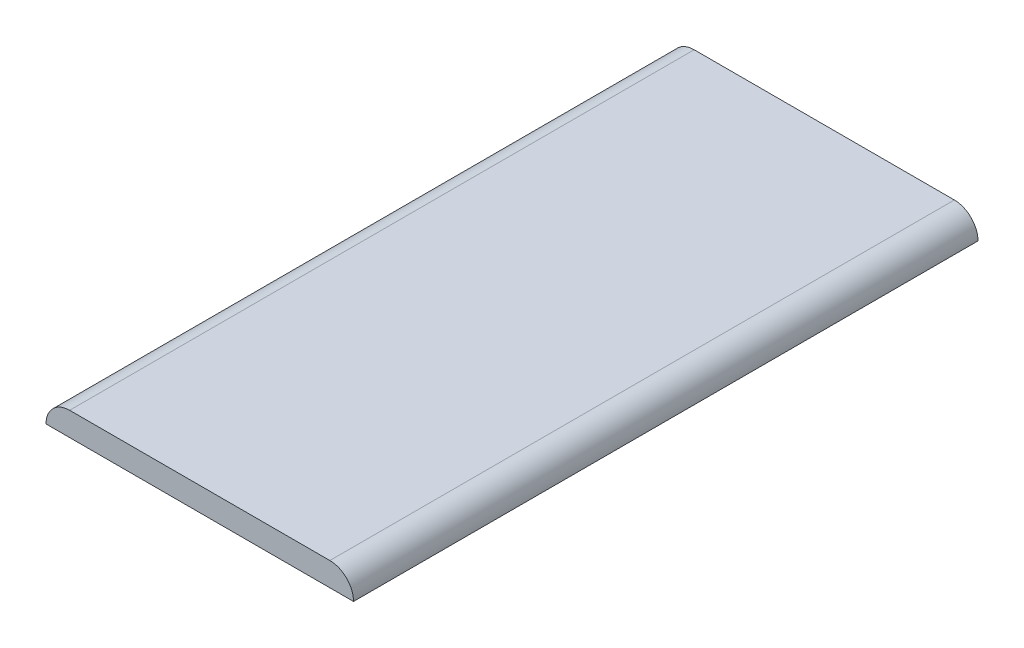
from build123d import *

# Parameters (mm, degrees)
SKETCH2_W           = 65
SKETCH2_H           = 30
BOSS_EXTRUDE1_DEPTH = 132
CHAMFER1_SIZE       = 12
CHAMFER1_SIZE2      = 17.137776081
FILLET1_R           = 10
CHAMFER3_SIZE       = 12
CHAMFER3_SIZE2      = 17.137776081
FILLET2_R           = 10
FILLET3_R           = 5
FILLET4_R           = 5
FILLET6_R           = 5
SKETCH4_W           = 65
SKETCH4_H           = 132
CUT_EXTRUDE2_DEPTH  = 25


with BuildPart() as part:
    # Sketch2 → Boss-Extrude1 (new body)
    with BuildSketch(Plane.XY):
        with Locations((32.5, 15)):
            Rectangle(SKETCH2_W, SKETCH2_H)
    extrude(amount=BOSS_EXTRUDE1_DEPTH)

    # Chamfer1
    chamfer1_edges = [part.edges().sort_by_distance(p)[0] for p in [
        (65, 0, 66),
    ]]
    chamfer1_side = [part.faces().sort_by_distance(p)[0] for p in [
        (32.5, 0, 66),
    ]]
    chamfer(chamfer1_edges, length=CHAMFER1_SIZE, length2=CHAMFER1_SIZE2, reference=chamfer1_side[0])

    # Fillet1
    fillet1_edges = [part.edges().sort_by_distance(p)[0] for p in [
        (65, 17.137776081, 66),
    ]]
    fillet(fillet1_edges, radius=FILLET1_R)

    # Chamfer3
    chamfer3_edges = [part.edges().sort_by_distance(p)[0] for p in [
        (0, 0, 66),
    ]]
    chamfer3_side = [part.faces().sort_by_distance(p)[0] for p in [
        (26.5, 0, 66),
    ]]
    chamfer(chamfer3_edges, length=CHAMFER3_SIZE, length2=CHAMFER3_SIZE2, reference=chamfer3_side[0])

    # Fillet2
    fillet2_edges = [part.edges().sort_by_distance(p)[0] for p in [
        (0, 17.137776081, 66),
    ]]
    fillet(fillet2_edges, radius=FILLET2_R)

    # Fillet3
    fillet3_edges = [part.edges().sort_by_distance(p)[0] for p in [
        (65, 30, 66),
    ]]
    fillet(fillet3_edges, radius=FILLET3_R)

    # Fillet4
    fillet4_edges = [part.edges().sort_by_distance(p)[0] for p in [
        (0, 30, 66),
    ]]
    fillet(fillet4_edges, radius=FILLET4_R)

    # Fillet6
    fillet6_edges = [part.edges().sort_by_distance(p)[0] for p in [
        (53, 0, 66),
        (12, 0, 66),
    ]]
    fillet(fillet6_edges, radius=FILLET6_R)

    # Sketch4 → Cut-Extrude2 (cut)
    with BuildSketch(Plane.XZ):
        with Locations((32.5, 66)):
            Rectangle(SKETCH4_W, SKETCH4_H)
    extrude(amount=-CUT_EXTRUDE2_DEPTH, mode=Mode.SUBTRACT)


solid = part.part
